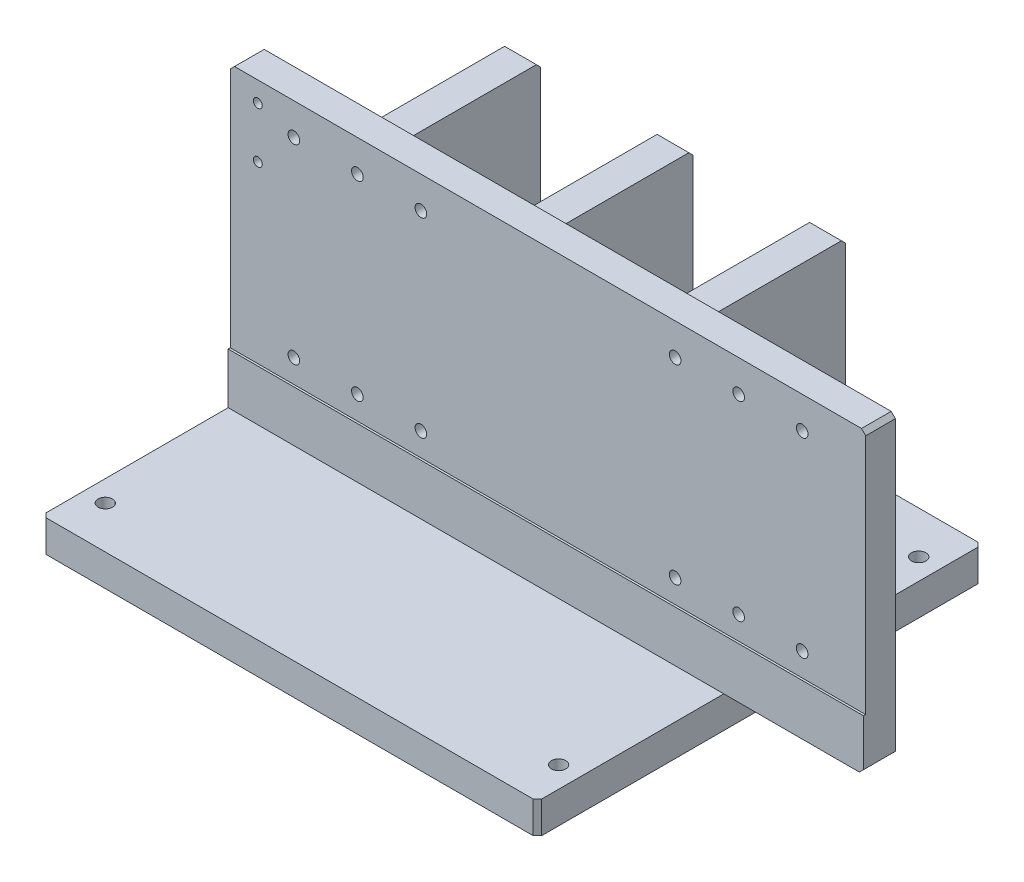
from build123d import *

# Parameters (mm, degrees)
SKETCH_1_W                    = 234
SKETCH_1_H                    = 210
EXTRUDE_1_DEPTH               = 15
SKETCH_2_W                    = 300
SKETCH_2_H                    = 15
EXTRUDE_2_DEPTH               = 140
SKETCH_3_W                    = 300
SKETCH_3_H                    = 116
CUT_EXTRUDE_1_DEPTH           = 1
SKETCH_4_W                    = 15
SKETCH_4_H                    = 80
EXTRUDE_3_DEPTH               = 120
EXTRUDE_3_2_DEPTH             = 120
EXTRUDE_3_3_DEPTH             = 120
CUT_EXTRUDE_2_DEPTH           = 272.407903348
SKETCH_7_W                    = 3.4
SKETCH_7_H                    = 15
HOLE_WIZARD_M8_1_AT_2_COUNT   = 2
HOLE_WIZARD_M8_1_AT_2_PITCH   = 214
HOLE_WIZARD_M8_1_AT_3_COUNT   = 2
HOLE_WIZARD_M8_1_AT_3_PITCH   = 170
HOLE_WIZARD_M8_1_AT_4_COUNT   = 2
HOLE_WIZARD_M8_1_AT_4_PITCH   = 273.305689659
F_6_0MM_1_AT_2_COUNT          = 2
F_6_0MM_1_AT_2_PITCH          = 214
HOLE_WIZARD_M5_1_AT_2_COUNT   = 2
HOLE_WIZARD_M5_1_AT_2_PITCH   = 36
HOLE_WIZARD_M5_1_2_AT_2_COUNT = 2
HOLE_WIZARD_M5_1_2_AT_2_PITCH = 30
HOLE_WIZARD_M5_1_2_AT_3_COUNT = 2
HOLE_WIZARD_M5_1_2_AT_3_PITCH = 60
HOLE_WIZARD_M5_1_2_AT_4_COUNT = 2
HOLE_WIZARD_M5_1_2_AT_4_PITCH = 90
HOLE_WIZARD_M5_1_2_AT_5_COUNT = 2
HOLE_WIZARD_M5_1_2_AT_5_PITCH = 94.868329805
HOLE_WIZARD_M5_1_2_AT_6_COUNT = 2
HOLE_WIZARD_M5_1_2_AT_6_PITCH = 108.166538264
PATTERN_LINEAR_1_COUNT        = 2
PATTERN_LINEAR_1_PITCH        = 180
HOLE_WIZARD_M5_2_AT_2_COUNT   = 2
HOLE_WIZARD_M5_2_AT_2_PITCH   = 24
CHAMFER_1_SIZE                = 2
CHAMFER_2_SIZE                = 2


with BuildPart() as part:
    # Sketch 1 → Extrude 1 (new body)
    with BuildSketch(Plane(origin=(0, 0, 0), x_dir=(1, 0, 0), z_dir=(0, 1, 0))):
        Rectangle(SKETCH_1_W, SKETCH_1_H)
    extrude(amount=EXTRUDE_1_DEPTH)

    # Sketch 7 → Hole Wizard M8 _ _1 (revolve, cut)
    with BuildSketch(Plane(origin=(-107, 15, -85), x_dir=(0, 0, 1), z_dir=(1, 0, 0))):
        with Locations((1.7, 7.5)):
            Rectangle(SKETCH_7_W, SKETCH_7_H)
    hole_wizard_m8_1 = revolve(axis=Axis((-107, 21.35, -85), (0, -1, 0)), mode=Mode.SUBTRACT)

    # Hole Wizard M8 _ _1 at 2: Hole Wizard M8 _ _1 ×2
    with Locations(*[(i * HOLE_WIZARD_M8_1_AT_2_PITCH, 0, 0) for i in range(1, HOLE_WIZARD_M8_1_AT_2_COUNT)]):
        add(hole_wizard_m8_1, mode=Mode.SUBTRACT)

    # Hole Wizard M8 _ _1 at 3: Hole Wizard M8 _ _1 ×2
    with Locations(*[(0, 0, i * HOLE_WIZARD_M8_1_AT_3_PITCH) for i in range(1, HOLE_WIZARD_M8_1_AT_3_COUNT)]):
        add(hole_wizard_m8_1, mode=Mode.SUBTRACT)

    # Hole Wizard M8 _ _1 at 4: Hole Wizard M8 _ _1 ×2
    with Locations(*[Vector(0.7830060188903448, 0, 0.6220141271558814) * (i * HOLE_WIZARD_M8_1_AT_4_PITCH) for i in range(1, HOLE_WIZARD_M8_1_AT_4_COUNT)]):
        add(hole_wizard_m8_1, mode=Mode.SUBTRACT)

    # Sketch 9 → 6.0mm _ _1 (revolve, cut)
    with BuildSketch(Plane(origin=(-107, 0, 0), x_dir=(0, 0, -1), z_dir=(1, 0, 0))):
        Polygon((0, 0), (0, 11.802581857), (3, 10), (3, 0), align=None)
    f_6_0mm_1 = revolve(axis=Axis((-107, -6.35, 0), (0, 1, 0)), mode=Mode.SUBTRACT)

    # 6.0mm _ _1 at 2: 6.0mm _ _1 ×2
    with Locations(*[(i * F_6_0MM_1_AT_2_PITCH, 0, 0) for i in range(1, F_6_0MM_1_AT_2_COUNT)]):
        add(f_6_0mm_1, mode=Mode.SUBTRACT)

    # Sketch 11 → Hole Wizard M5 _ _1 (revolve, cut)
    with BuildSketch(Plane(origin=(-117, 7.5, -45), x_dir=(0, 0, 1), z_dir=(0, 1, 0))):
        Polygon((0, 0), (0, 13.2618073), (2.1, 12), (2.1, 0), align=None)
    hole_wizard_m5_1 = revolve(axis=Axis((-123.35, 7.5, -45), (1, 0, 0)), mode=Mode.SUBTRACT)

    # Hole Wizard M5 _ _1 at 2: Hole Wizard M5 _ _1 ×2
    with Locations(*[(0, 0, i * HOLE_WIZARD_M5_1_AT_2_PITCH) for i in range(1, HOLE_WIZARD_M5_1_AT_2_COUNT)]):
        add(hole_wizard_m5_1, mode=Mode.SUBTRACT)

    # Chamfer 2
    chamfer_2_edges = [part.edges().sort_by_distance(p)[0] for p in [
        (117, 7.5, 105),
        (-117, 7.5, 105),
        (-117, 7.5, -105),
        (117, 7.5, -105),
    ]]
    chamfer(chamfer_2_edges, length=CHAMFER_2_SIZE)


with BuildPart() as body_2:
    # Sketch 2 → Extrude 2 (new body)
    with BuildSketch(Plane(origin=(0, 15, 0), x_dir=(1, 0, 0), z_dir=(0, 1, 0))):
        with Locations((33, -9.5)):
            Rectangle(SKETCH_2_W, SKETCH_2_H)
    extrude(amount=EXTRUDE_2_DEPTH)

    # Sketch 3 → Cut-Extrude 1 (cut)
    with BuildSketch(Plane.XY.offset(17)):
        with Locations((33, 97)):
            Rectangle(SKETCH_3_W, SKETCH_3_H)
    extrude(amount=-CUT_EXTRUDE_1_DEPTH, mode=Mode.SUBTRACT)

    # Sketch 13 → Hole Wizard M5 _ _ _ _ _1 2 (revolve, cut)
    with BuildSketch(Plane(origin=(-27, 140, 2), x_dir=(0, 1, 0), z_dir=(1, 0, 0))):
        Polygon((0, 0), (0, 103), (2.75, 103), (2.75, 7), (4.75, 7), (4.75, 0), align=None)
    hole_wizard_m5_1_2 = revolve(axis=Axis((-27, 140, -4.35), (0, 0, 1)), mode=Mode.SUBTRACT)

    # Hole Wizard M5 _ _ _ _ _1 2 at 2: Hole Wizard M5 _ _ _ _ _1 2 ×2
    with Locations(*[(-i * HOLE_WIZARD_M5_1_2_AT_2_PITCH, 0, 0) for i in range(1, HOLE_WIZARD_M5_1_2_AT_2_COUNT)]):
        add(hole_wizard_m5_1_2, mode=Mode.SUBTRACT)

    # Hole Wizard M5 _ _ _ _ _1 2 at 3: Hole Wizard M5 _ _ _ _ _1 2 ×2
    with Locations(*[(-i * HOLE_WIZARD_M5_1_2_AT_3_PITCH, 0, 0) for i in range(1, HOLE_WIZARD_M5_1_2_AT_3_COUNT)]):
        add(hole_wizard_m5_1_2, mode=Mode.SUBTRACT)

    # Hole Wizard M5 _ _ _ _ _1 2 at 4: Hole Wizard M5 _ _ _ _ _1 2 ×2
    with Locations(*[(0, -i * HOLE_WIZARD_M5_1_2_AT_4_PITCH, 0) for i in range(1, HOLE_WIZARD_M5_1_2_AT_4_COUNT)]):
        add(hole_wizard_m5_1_2, mode=Mode.SUBTRACT)

    # Hole Wizard M5 _ _ _ _ _1 2 at 5: Hole Wizard M5 _ _ _ _ _1 2 ×2
    with Locations(*[Vector(-0.31622776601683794, -0.9486832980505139, 0) * (i * HOLE_WIZARD_M5_1_2_AT_5_PITCH) for i in range(1, HOLE_WIZARD_M5_1_2_AT_5_COUNT)]):
        add(hole_wizard_m5_1_2, mode=Mode.SUBTRACT)

    # Hole Wizard M5 _ _ _ _ _1 2 at 6: Hole Wizard M5 _ _ _ _ _1 2 ×2
    with Locations(*[Vector(-0.5547001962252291, -0.8320502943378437, 0) * (i * HOLE_WIZARD_M5_1_2_AT_6_PITCH) for i in range(1, HOLE_WIZARD_M5_1_2_AT_6_COUNT)]):
        add(hole_wizard_m5_1_2, mode=Mode.SUBTRACT)

    # Pattern Linear 1: Hole Wizard M5 _ _ _ _ _1 2 ×2
    with Locations(*[(i * PATTERN_LINEAR_1_PITCH, 0, 0) for i in range(1, PATTERN_LINEAR_1_COUNT)]):
        add(hole_wizard_m5_1_2, mode=Mode.SUBTRACT)

    # Pattern Linear 1 copy 1 sketch → Pattern Linear 1 copy 1 (revolve, cut)
    with BuildSketch(Plane(origin=(123, 140, 2), x_dir=(0, 1, 0), z_dir=(1, 0, 0))):
        Polygon((0, 0), (0, 103), (2.75, 103), (2.75, 7), (4.75, 7), (4.75, 0), align=None)
    revolve(axis=Axis((123, 140, -4.35), (0, 0, 1)), mode=Mode.SUBTRACT)

    # Pattern Linear 1 copy 2 sketch → Pattern Linear 1 copy 2 (revolve, cut)
    with BuildSketch(Plane(origin=(93, 140, 2), x_dir=(0, 1, 0), z_dir=(1, 0, 0))):
        Polygon((0, 0), (0, 103), (2.75, 103), (2.75, 7), (4.75, 7), (4.75, 0), align=None)
    revolve(axis=Axis((93, 140, -4.35), (0, 0, 1)), mode=Mode.SUBTRACT)

    # Pattern Linear 1 copy 3 sketch → Pattern Linear 1 copy 3 (revolve, cut)
    with BuildSketch(Plane(origin=(153, 50, 2), x_dir=(0, 1, 0), z_dir=(1, 0, 0))):
        Polygon((0, 0), (0, 103), (2.75, 103), (2.75, 7), (4.75, 7), (4.75, 0), align=None)
    revolve(axis=Axis((153, 50, -4.35), (0, 0, 1)), mode=Mode.SUBTRACT)

    # Pattern Linear 1 copy 4 sketch → Pattern Linear 1 copy 4 (revolve, cut)
    with BuildSketch(Plane(origin=(123, 50, 2), x_dir=(0, 1, 0), z_dir=(1, 0, 0))):
        Polygon((0, 0), (0, 103), (2.75, 103), (2.75, 7), (4.75, 7), (4.75, 0), align=None)
    revolve(axis=Axis((123, 50, -4.35), (0, 0, 1)), mode=Mode.SUBTRACT)

    # Pattern Linear 1 copy 5 sketch → Pattern Linear 1 copy 5 (revolve, cut)
    with BuildSketch(Plane(origin=(93, 50, 2), x_dir=(0, 1, 0), z_dir=(1, 0, 0))):
        Polygon((0, 0), (0, 103), (2.75, 103), (2.75, 7), (4.75, 7), (4.75, 0), align=None)
    revolve(axis=Axis((93, 50, -4.35), (0, 0, 1)), mode=Mode.SUBTRACT)

    # Sketch 15 → Hole Wizard M5 _ _2 (revolve, cut)
    with BuildSketch(Plane(origin=(-104, 145.5, 2), x_dir=(0, 1, 0), z_dir=(1, 0, 0))):
        Polygon((0, 0), (0, 103), (2.525, 103), (2.1, 102.575), (2.1, 0.425), (2.525, 0), align=None)
    hole_wizard_m5_2 = revolve(axis=Axis((-104, 145.5, -4.35), (0, 0, 1)), mode=Mode.SUBTRACT)

    # Hole Wizard M5 _ _2 at 2: Hole Wizard M5 _ _2 ×2
    with Locations(*[(0, -i * HOLE_WIZARD_M5_2_AT_2_PITCH, 0) for i in range(1, HOLE_WIZARD_M5_2_AT_2_COUNT)]):
        add(hole_wizard_m5_2, mode=Mode.SUBTRACT)

    # Chamfer 1
    chamfer_1_edges = [body_2.edges().sort_by_distance(p)[0] for p in [
        (183, 155, 9),
        (-117, 155, 9),
        (183, 15, 9.5),
    ]]
    chamfer(chamfer_1_edges, length=CHAMFER_1_SIZE)


with BuildPart() as body_3:
    # Sketch 4 → Extrude 3 (new body)
    with BuildSketch(Plane(origin=(0, 15, 0), x_dir=(1, 0, 0), z_dir=(0, 1, 0))):
        with Locations((-72, 38)):
            Rectangle(SKETCH_4_W, SKETCH_4_H)
    extrude(amount=EXTRUDE_3_DEPTH)


with BuildPart() as body_4:
    # Sketch 4 → Extrude 3 2 (new body)
    with BuildSketch(Plane(origin=(0, 15, 0), x_dir=(1, 0, 0), z_dir=(0, 1, 0))):
        with Locations((0, 38)):
            Rectangle(SKETCH_4_W, SKETCH_4_H)
    extrude(amount=EXTRUDE_3_2_DEPTH)


with BuildPart() as body_5:
    # Sketch 4 → Extrude 3 3 (new body)
    with BuildSketch(Plane(origin=(0, 15, 0), x_dir=(1, 0, 0), z_dir=(0, 1, 0))):
        with Locations((72, 38)):
            Rectangle(SKETCH_4_W, SKETCH_4_H)
    extrude(amount=EXTRUDE_3_3_DEPTH)


with BuildPart() as cut_extrude_2_tool:
    # Sketch 5 → Cut-Extrude 2 (new, through all)
    with BuildSketch(Plane(origin=(79.5, 0, 0), x_dir=(0, 0, -1), z_dir=(1, 0, 0))):
        Polygon((78, 135), (76, 135), (78, 133), align=None)
    extrude(amount=-CUT_EXTRUDE_2_DEPTH)


with BuildPart() as body_3_1:
    add(body_3.part)

    # Cut-Extrude 2: cut by cut_extrude_2_tool
    add(cut_extrude_2_tool.part, mode=Mode.SUBTRACT)


with BuildPart() as body_4_1:
    add(body_4.part)

    # Cut-Extrude 2: cut by cut_extrude_2_tool
    add(cut_extrude_2_tool.part, mode=Mode.SUBTRACT)


with BuildPart() as body_5_1:
    add(body_5.part)

    # Cut-Extrude 2: cut by cut_extrude_2_tool
    add(cut_extrude_2_tool.part, mode=Mode.SUBTRACT)


solid = Compound([part.part, body_2.part, body_3_1.part, body_4_1.part, body_5_1.part])
